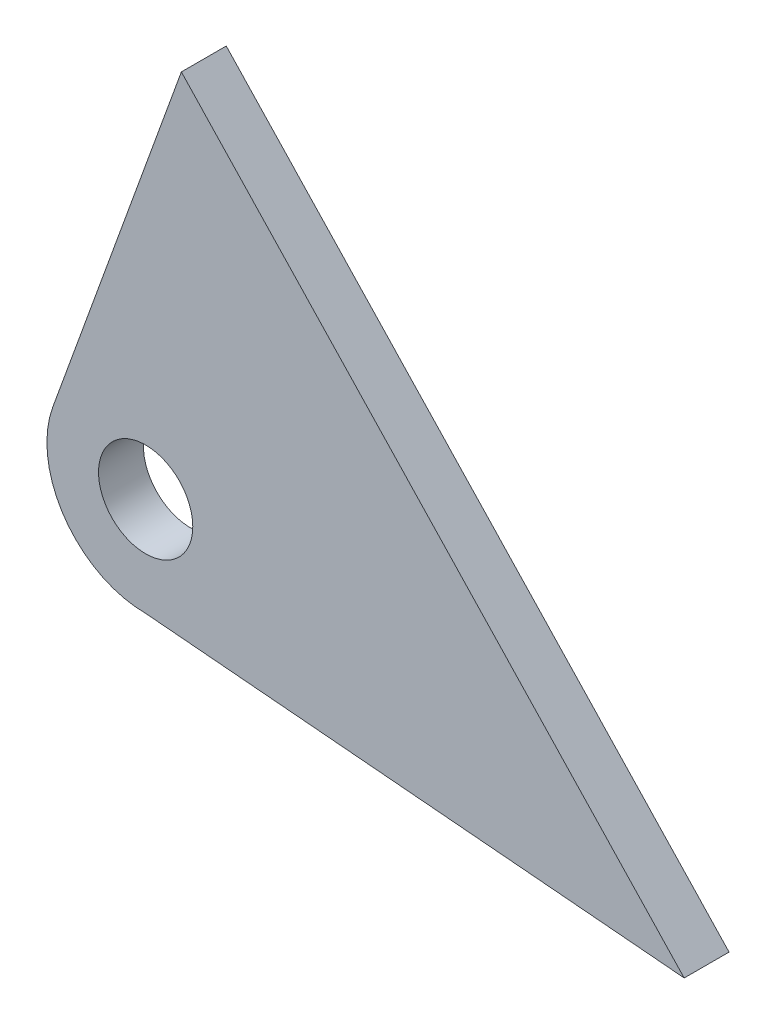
ISO-10303-21;
HEADER;
FILE_DESCRIPTION(('STEP AP214'),'2;1');
FILE_NAME('part.step','',(''),(''),'','','');
FILE_SCHEMA(('AUTOMOTIVE_DESIGN { 1 0 10303 214 1 1 1 1 }'));
ENDSEC;
DATA;
#1=APPLICATION_CONTEXT('core data for automotive mechanical design processes');
#2=APPLICATION_PROTOCOL_DEFINITION('international standard','automotive_design',2000,#1);
#3=PRODUCT_CONTEXT('',#1,'mechanical');
#4=PRODUCT('Part','Part','',(#3));
#5=PRODUCT_RELATED_PRODUCT_CATEGORY('part','',(#4));
#6=PRODUCT_DEFINITION_FORMATION('','',#4);
#7=PRODUCT_DEFINITION_CONTEXT('part definition',#1,'design');
#8=PRODUCT_DEFINITION('design','',#6,#7);
#9=PRODUCT_DEFINITION_SHAPE('','',#8);
#10=(LENGTH_UNIT() NAMED_UNIT(*) SI_UNIT(.MILLI.,.METRE.));
#11=(NAMED_UNIT(*) PLANE_ANGLE_UNIT() SI_UNIT($,.RADIAN.));
#12=(NAMED_UNIT(*) SI_UNIT($,.STERADIAN.) SOLID_ANGLE_UNIT());
#13=UNCERTAINTY_MEASURE_WITH_UNIT(LENGTH_MEASURE(1.E-05),#10,'distance_accuracy_value','');
#14=(GEOMETRIC_REPRESENTATION_CONTEXT(3) GLOBAL_UNCERTAINTY_ASSIGNED_CONTEXT((#13)) GLOBAL_UNIT_ASSIGNED_CONTEXT((#10,
#11,#12)) REPRESENTATION_CONTEXT('',''));
#15=CARTESIAN_POINT('',(0.,0.,0.));
#16=DIRECTION('',(0.,0.,1.));
#17=DIRECTION('',(1.,0.,0.));
#18=AXIS2_PLACEMENT_3D('',#15,#16,#17);
#19=CARTESIAN_POINT('',(-15.,-10.,-15.0000000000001));
#20=DIRECTION('',(0.,0.,1.));
#21=DIRECTION('',(1.,0.,0.));
#22=AXIS2_PLACEMENT_3D('',#19,#20,#21);
#23=PLANE('',#22);
#24=CARTESIAN_POINT('',(-15.,-10.,-15.0000000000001));
#25=DIRECTION('',(0.,0.,1.));
#26=DIRECTION('',(1.,0.,0.));
#27=AXIS2_PLACEMENT_3D('',#24,#25,#26);
#28=CIRCLE('',#27,11.);
#29=CARTESIAN_POINT('',(-25.3409426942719,-6.24967945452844,-15.0000000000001));
#30=VERTEX_POINT('',#29);
#31=CARTESIAN_POINT('',(-15.,-21.,-15.0000000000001));
#32=VERTEX_POINT('',#31);
#33=EDGE_CURVE('E82',#30,#32,#28,.T.);
#34=ORIENTED_EDGE('',*,*,#33,.T.);
#35=DIRECTION('',(0.996294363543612,-0.086008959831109,0.));
#36=VECTOR('',#35,1.);
#37=CARTESIAN_POINT('',(-15.,-21.,-15.0000000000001));
#38=LINE('',#37,#36);
#39=CARTESIAN_POINT('',(45.0000000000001,-26.1797317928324,-15.0000000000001));
#40=VERTEX_POINT('',#39);
#41=EDGE_CURVE('E77',#32,#40,#38,.T.);
#42=ORIENTED_EDGE('',*,*,#41,.T.);
#43=DIRECTION('',(-0.686031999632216,0.727571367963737,0.));
#44=VECTOR('',#43,1.);
#45=CARTESIAN_POINT('',(-11.0215369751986,33.2339199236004,-15.0000000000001));
#46=LINE('',#45,#44);
#47=CARTESIAN_POINT('',(-11.0215369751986,33.2339199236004,-15.0000000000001));
#48=VERTEX_POINT('',#47);
#49=EDGE_CURVE('E80',#40,#48,#46,.T.);
#50=ORIENTED_EDGE('',*,*,#49,.T.);
#51=DIRECTION('',(-0.340938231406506,-0.940085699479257,0.));
#52=VECTOR('',#51,1.);
#53=CARTESIAN_POINT('',(-25.3409426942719,-6.24967945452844,-15.0000000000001));
#54=LINE('',#53,#52);
#55=EDGE_CURVE('E47',#48,#30,#54,.T.);
#56=ORIENTED_EDGE('',*,*,#55,.T.);
#57=EDGE_LOOP('',(#34,#42,#50,#56));
#58=FACE_BOUND('',#57,.T.);
#59=CARTESIAN_POINT('',(-15.,-10.,-15.0000000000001));
#60=DIRECTION('',(0.,0.,1.));
#61=DIRECTION('',(1.,0.,0.));
#62=AXIS2_PLACEMENT_3D('',#59,#60,#61);
#63=CIRCLE('',#62,5.25);
#64=CARTESIAN_POINT('',(-9.75000000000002,-10.,-15.0000000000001));
#65=VERTEX_POINT('',#64);
#66=EDGE_CURVE('E97',#65,#65,#63,.T.);
#67=ORIENTED_EDGE('',*,*,#66,.F.);
#68=EDGE_LOOP('',(#67));
#69=FACE_BOUND('',#68,.T.);
#70=ADVANCED_FACE('F30',(#58,#69),#23,.T.);
#71=CARTESIAN_POINT('',(-15.,-10.,-20.0000000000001));
#72=DIRECTION('',(0.,0.,1.));
#73=DIRECTION('',(1.,0.,0.));
#74=AXIS2_PLACEMENT_3D('',#71,#72,#73);
#75=PLANE('',#74);
#76=CARTESIAN_POINT('',(-15.,-10.,-20.0000000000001));
#77=DIRECTION('',(0.,0.,1.));
#78=DIRECTION('',(1.,0.,0.));
#79=AXIS2_PLACEMENT_3D('',#76,#77,#78);
#80=CIRCLE('',#79,11.);
#81=CARTESIAN_POINT('',(-25.3409426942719,-6.24967945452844,-20.0000000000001));
#82=VERTEX_POINT('',#81);
#83=CARTESIAN_POINT('',(-15.,-21.,-20.0000000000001));
#84=VERTEX_POINT('',#83);
#85=EDGE_CURVE('E94',#82,#84,#80,.T.);
#86=ORIENTED_EDGE('',*,*,#85,.F.);
#87=DIRECTION('',(-0.340938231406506,-0.940085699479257,0.));
#88=VECTOR('',#87,1.);
#89=CARTESIAN_POINT('',(-25.3409426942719,-6.24967945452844,-20.0000000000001));
#90=LINE('',#89,#88);
#91=CARTESIAN_POINT('',(-11.0215369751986,33.2339199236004,-20.0000000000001));
#92=VERTEX_POINT('',#91);
#93=EDGE_CURVE('E70',#92,#82,#90,.T.);
#94=ORIENTED_EDGE('',*,*,#93,.F.);
#95=DIRECTION('',(-0.686031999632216,0.727571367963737,0.));
#96=VECTOR('',#95,1.);
#97=CARTESIAN_POINT('',(-11.0215369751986,33.2339199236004,-20.0000000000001));
#98=LINE('',#97,#96);
#99=CARTESIAN_POINT('',(45.0000000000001,-26.1797317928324,-20.0000000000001));
#100=VERTEX_POINT('',#99);
#101=EDGE_CURVE('E64',#100,#92,#98,.T.);
#102=ORIENTED_EDGE('',*,*,#101,.F.);
#103=DIRECTION('',(0.996294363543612,-0.086008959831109,0.));
#104=VECTOR('',#103,1.);
#105=CARTESIAN_POINT('',(-15.,-21.,-20.0000000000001));
#106=LINE('',#105,#104);
#107=EDGE_CURVE('E86',#84,#100,#106,.T.);
#108=ORIENTED_EDGE('',*,*,#107,.F.);
#109=EDGE_LOOP('',(#86,#94,#102,#108));
#110=FACE_BOUND('',#109,.T.);
#111=CARTESIAN_POINT('',(-15.,-10.,-20.0000000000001));
#112=DIRECTION('',(0.,0.,1.));
#113=DIRECTION('',(1.,0.,0.));
#114=AXIS2_PLACEMENT_3D('',#111,#112,#113);
#115=CIRCLE('',#114,5.25);
#116=CARTESIAN_POINT('',(-9.75000000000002,-10.,-20.0000000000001));
#117=VERTEX_POINT('',#116);
#118=EDGE_CURVE('E109',#117,#117,#115,.T.);
#119=ORIENTED_EDGE('',*,*,#118,.T.);
#120=EDGE_LOOP('',(#119));
#121=FACE_BOUND('',#120,.T.);
#122=ADVANCED_FACE('F105',(#110,#121),#75,.F.);
#123=CARTESIAN_POINT('',(-15.,-10.,-15.0000000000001));
#124=DIRECTION('',(0.,0.,-1.));
#125=DIRECTION('',(-1.,0.,0.));
#126=AXIS2_PLACEMENT_3D('',#123,#124,#125);
#127=CYLINDRICAL_SURFACE('',#126,11.);
#128=ORIENTED_EDGE('',*,*,#85,.T.);
#129=DIRECTION('',(0.,0.,-1.));
#130=VECTOR('',#129,1.);
#131=CARTESIAN_POINT('',(-15.,-21.,-15.0000000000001));
#132=LINE('',#131,#130);
#133=EDGE_CURVE('E11',#32,#84,#132,.T.);
#134=ORIENTED_EDGE('',*,*,#133,.F.);
#135=ORIENTED_EDGE('',*,*,#33,.F.);
#136=DIRECTION('',(0.,0.,-1.));
#137=VECTOR('',#136,1.);
#138=CARTESIAN_POINT('',(-25.3409426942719,-6.24967945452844,-15.0000000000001));
#139=LINE('',#138,#137);
#140=EDGE_CURVE('E90',#30,#82,#139,.T.);
#141=ORIENTED_EDGE('',*,*,#140,.T.);
#142=EDGE_LOOP('',(#128,#134,#135,#141));
#143=FACE_BOUND('',#142,.T.);
#144=ADVANCED_FACE('F32',(#143),#127,.T.);
#145=CARTESIAN_POINT('',(-15.,-21.,-15.0000000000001));
#146=DIRECTION('',(0.086008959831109,0.996294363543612,0.));
#147=DIRECTION('',(-0.996294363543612,0.086008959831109,0.));
#148=AXIS2_PLACEMENT_3D('',#145,#146,#147);
#149=PLANE('',#148);
#150=ORIENTED_EDGE('',*,*,#107,.T.);
#151=DIRECTION('',(0.,0.,-1.));
#152=VECTOR('',#151,1.);
#153=CARTESIAN_POINT('',(45.0000000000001,-26.1797317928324,-15.0000000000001));
#154=LINE('',#153,#152);
#155=EDGE_CURVE('E39',#40,#100,#154,.T.);
#156=ORIENTED_EDGE('',*,*,#155,.F.);
#157=ORIENTED_EDGE('',*,*,#41,.F.);
#158=ORIENTED_EDGE('',*,*,#133,.T.);
#159=EDGE_LOOP('',(#150,#156,#157,#158));
#160=FACE_BOUND('',#159,.T.);
#161=ADVANCED_FACE('F85',(#160),#149,.F.);
#162=CARTESIAN_POINT('',(-11.0215369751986,33.2339199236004,-15.0000000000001));
#163=DIRECTION('',(-0.727571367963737,-0.686031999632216,0.));
#164=DIRECTION('',(0.686031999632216,-0.727571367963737,0.));
#165=AXIS2_PLACEMENT_3D('',#162,#163,#164);
#166=PLANE('',#165);
#167=ORIENTED_EDGE('',*,*,#101,.T.);
#168=DIRECTION('',(0.,0.,-1.));
#169=VECTOR('',#168,1.);
#170=CARTESIAN_POINT('',(-11.0215369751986,33.2339199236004,-15.0000000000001));
#171=LINE('',#170,#169);
#172=EDGE_CURVE('E87',#48,#92,#171,.T.);
#173=ORIENTED_EDGE('',*,*,#172,.F.);
#174=ORIENTED_EDGE('',*,*,#49,.F.);
#175=ORIENTED_EDGE('',*,*,#155,.T.);
#176=EDGE_LOOP('',(#167,#173,#174,#175));
#177=FACE_BOUND('',#176,.T.);
#178=ADVANCED_FACE('F88',(#177),#166,.F.);
#179=CARTESIAN_POINT('',(-25.3409426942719,-6.24967945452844,-15.0000000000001));
#180=DIRECTION('',(0.940085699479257,-0.340938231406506,0.));
#181=DIRECTION('',(0.340938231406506,0.940085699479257,0.));
#182=AXIS2_PLACEMENT_3D('',#179,#180,#181);
#183=PLANE('',#182);
#184=ORIENTED_EDGE('',*,*,#93,.T.);
#185=ORIENTED_EDGE('',*,*,#140,.F.);
#186=ORIENTED_EDGE('',*,*,#55,.F.);
#187=ORIENTED_EDGE('',*,*,#172,.T.);
#188=EDGE_LOOP('',(#184,#185,#186,#187));
#189=FACE_BOUND('',#188,.T.);
#190=ADVANCED_FACE('F102',(#189),#183,.F.);
#191=CARTESIAN_POINT('',(-15.,-10.,-15.0000000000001));
#192=DIRECTION('',(0.,0.,-1.));
#193=DIRECTION('',(-1.,0.,0.));
#194=AXIS2_PLACEMENT_3D('',#191,#192,#193);
#195=CYLINDRICAL_SURFACE('',#194,5.25);
#196=ORIENTED_EDGE('',*,*,#66,.T.);
#197=EDGE_LOOP('',(#196));
#198=FACE_BOUND('',#197,.T.);
#199=ORIENTED_EDGE('',*,*,#118,.F.);
#200=EDGE_LOOP('',(#199));
#201=FACE_BOUND('',#200,.T.);
#202=ADVANCED_FACE('F115',(#198,#201),#195,.F.);
#203=CLOSED_SHELL('',(#70,#122,#144,#161,#178,#190,#202));
#204=MANIFOLD_SOLID_BREP('B2',#203);
#205=ADVANCED_BREP_SHAPE_REPRESENTATION('',(#18,#204),#14);
#206=SHAPE_DEFINITION_REPRESENTATION(#9,#205);
ENDSEC;
END-ISO-10303-21;
